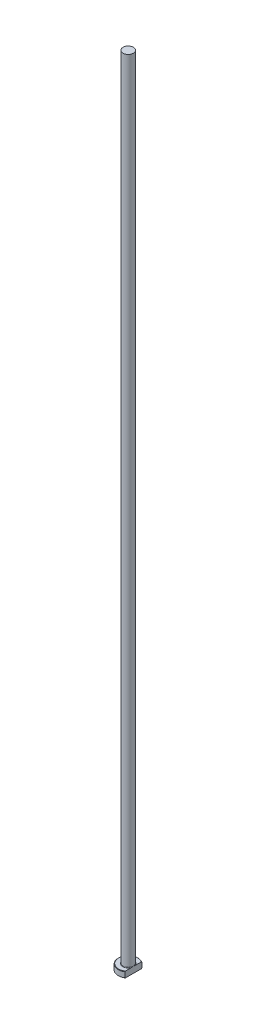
from build123d import *
from build123d.topology import SkipClean

# Parameters (mm, degrees)
CHAMFER1_SIZE = 0.2
FILLET1_R     = 0.2
KEY_DEPTH     = 401.062495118


with BuildPart() as part:
    # Sketch1 → Revolve1 (revolve)
    with BuildSketch(Plane.XY, mode=Mode.PRIVATE) as revolve1_sk:
        Polygon((0, 0), (-5, 0), (-5, 3), (-2.6, 3), (-2.6, 400), (0, 400), align=None)
    revolve(revolve1_sk.sketch.rotate(Axis((0, 259.958771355, 0), (0, -1, 0)), 270), axis=Axis((0, 259.958771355, 0), (0, -1, 0)))

    # Chamfer1
    chamfer1_edges = [part.edges().sort_by_distance(p)[0] for p in [
        (0, 3, -5),
        (0, 0, -5),
    ]]
    chamfer(chamfer1_edges, length=CHAMFER1_SIZE)

    # Fillet1
    fillet1_edges = [part.edges().sort_by_distance(p)[0] for p in [
        (0, 3, -2.6),
    ]]
    fillet(fillet1_edges, radius=FILLET1_R)

    # Sketch2 → KEY (cut, through all)
    with SkipClean():  # the faces are left unmerged after this step: merging them gives an invalid solid
        with BuildSketch(Plane(origin=(0, 0, 0), x_dir=(1, 0, 0), z_dir=(0, 1, 0))):
            with BuildLine():
                Line((2.6, 4.270831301), (2.6, -4.270831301))
                ThreePointArc((2.6, -4.270831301), (5, 0), (2.6, 4.270831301))
            make_face()
        extrude(amount=KEY_DEPTH, mode=Mode.SUBTRACT)


solid = part.part
